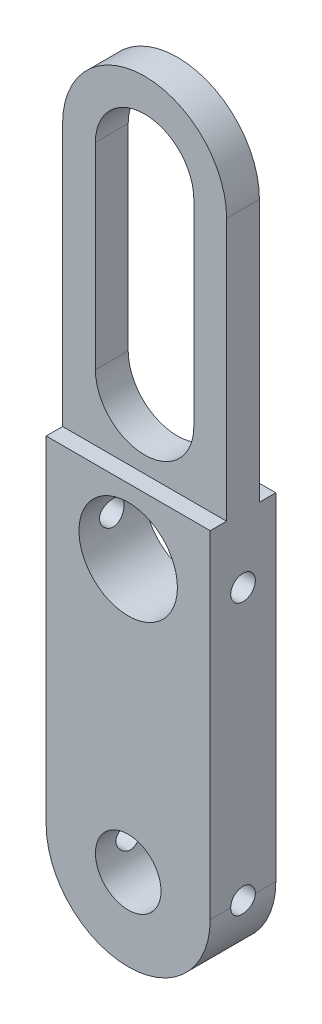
from build123d import *

# Parameters (mm, degrees)
SKETCH2_R               = 4.7625
SKETCH2_R_2             = 3.175
EXTRUDE1_DEPTH          = 3.175
SKETCH3_W               = 3.175
SKETCH3_H               = 38.1
CUT_EXTRUDE1_DEPTH      = 41.597810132
CUT_EXTRUDE2_DEPTH      = 41.597810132
CUT_EXTRUDE2_DEPTH_BACK = 41.597810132
SKETCH4_R               = 1.190625


with BuildPart() as part:
    # Sketch2 → Extrude1 (new, symmetric)
    with BuildSketch(Plane.XY):
        with BuildLine():
            Line((-7.9375, 31.75), (-7.9375, -26.2382))
            ThreePointArc((-7.9375, -26.2382), (0, -34.1757), (7.9375, -26.2382))
            Line((7.9375, -26.2382), (7.9375, 31.75))
            ThreePointArc((7.9375, 31.75), (0, 39.6875), (-7.9375, 31.75))
        make_face()
        Circle(SKETCH2_R, mode=Mode.SUBTRACT)
        with Locations((0, -26.2382)):
            Circle(SKETCH2_R_2, mode=Mode.SUBTRACT)
        with BuildLine():
            Line((-4.7625, 31.75), (-4.7625, 12.7))
            ThreePointArc((-4.7625, 12.7), (0, 7.9375), (4.7625, 12.7))
            Line((4.7625, 12.7), (4.7625, 31.75))
            ThreePointArc((4.7625, 31.75), (0, 36.5125), (-4.7625, 31.75))
        make_face(mode=Mode.SUBTRACT)
    extrude(amount=EXTRUDE1_DEPTH, both=True)

    # Sketch3 → Cut-Extrude1 (cut, symmetric)
    with BuildSketch(Plane(origin=(0, 0, 0), x_dir=(0, 0, -1), z_dir=(1, 0, 0))):
        with Locations((3.175, 25.4)):
            Rectangle(SKETCH3_W, SKETCH3_H)
    cut_extrude1 = extrude(amount=CUT_EXTRUDE1_DEPTH, both=True, mode=Mode.SUBTRACT)

    # Mirror1: Cut-Extrude1 across plane
    add(cut_extrude1.mirror(Plane.XY), mode=Mode.SUBTRACT)

    # Sketch4 → Cut-Extrude2 (cut, two sides: drawn at the far end of the back side and taken through both)
    with BuildSketch(Plane(origin=(0, 0, 0), x_dir=(0, 0, -1), z_dir=(1, 0, 0)).offset(-CUT_EXTRUDE2_DEPTH_BACK)):
        Circle(SKETCH4_R)
        with Locations((0, -26.2382)):
            Circle(SKETCH4_R)
    extrude(amount=CUT_EXTRUDE2_DEPTH + CUT_EXTRUDE2_DEPTH_BACK, mode=Mode.SUBTRACT)


solid = part.part
